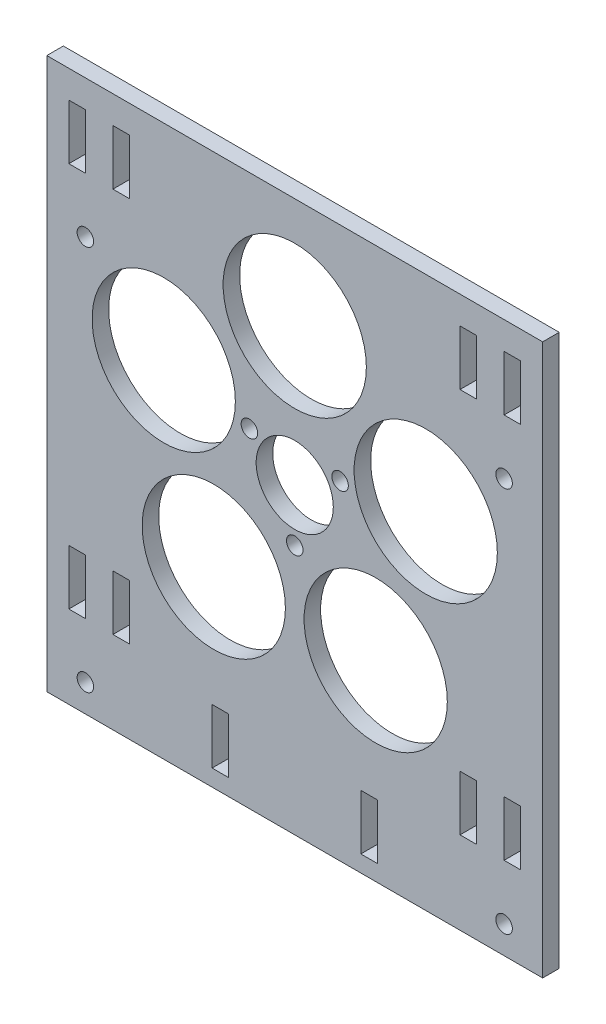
from build123d import *

# Parameters (mm, degrees)
EXTRUDE_2_DEPTH     = 3
SKETCH_5_W          = 3
SKETCH_5_H          = 10
CUT_EXTRUDE_1_DEPTH = 10
SKETCH_6_R          = 13
CUT_EXTRUDE_2_DEPTH = 10
SKETCH_7_R          = 7
SKETCH_7_R_2        = 1.5
CUT_EXTRUDE_3_DEPTH = 10
SKETCH_8_R          = 1.5
SKETCH_8_W          = 3
SKETCH_8_H          = 10
CUT_EXTRUDE_4_DEPTH = 10


with BuildPart() as part:
    # Sketch 3 → Extrude 2 (new body)
    with BuildSketch(Plane.XY):
        Polygon((45, 45), (-45, 45), (-45, -45), (-45, -55), (45, -55), (45, -45), align=None)
    extrude(amount=EXTRUDE_2_DEPTH)

    # Sketch 5 → Cut-Extrude 1 (cut)
    with BuildSketch(Plane.XY.offset(3)):
        with Locations((-31.5, 35)):
            Rectangle(SKETCH_5_W, SKETCH_5_H)
        with Locations((31.5, 35)):
            Rectangle(SKETCH_5_W, SKETCH_5_H)
        with Locations((-31.5, -35)):
            Rectangle(SKETCH_5_W, SKETCH_5_H)
        with Locations((31.5, -35)):
            Rectangle(SKETCH_5_W, SKETCH_5_H)
    extrude(amount=-CUT_EXTRUDE_1_DEPTH, mode=Mode.SUBTRACT)

    # Sketch 6 → Cut-Extrude 2 (cut)
    with BuildSketch(Plane.XY.offset(3)):
        with Locations((0, 25)):
            Circle(SKETCH_6_R)
        with Locations((23.776412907, 7.725424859)):
            Circle(SKETCH_6_R)
        with Locations((14.694631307, -20.225424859)):
            Circle(SKETCH_6_R)
        with Locations((-14.694631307, -20.225424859)):
            Circle(SKETCH_6_R)
        with Locations((-23.776412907, 7.725424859)):
            Circle(SKETCH_6_R)
    extrude(amount=-CUT_EXTRUDE_2_DEPTH, mode=Mode.SUBTRACT)

    # Sketch 7 → Cut-Extrude 3 (cut)
    with BuildSketch(Plane.XY.offset(3)):
        Circle(SKETCH_7_R)
        with Locations((0, -9.5)):
            Circle(SKETCH_7_R_2)
        with Locations((-8.227241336, 4.75)):
            Circle(SKETCH_7_R_2)
        with Locations((8.227241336, 4.75)):
            Circle(SKETCH_7_R_2)
    extrude(amount=-CUT_EXTRUDE_3_DEPTH, mode=Mode.SUBTRACT)

    # Sketch 8 → Cut-Extrude 4 (cut)
    with BuildSketch(Plane.XY.offset(3)):
        with Locations((-38, -50)):
            Circle(SKETCH_8_R)
        with Locations((-38, 20)):
            Circle(SKETCH_8_R)
        with Locations((38, 20)):
            Circle(SKETCH_8_R)
        with Locations((38, -50)):
            Circle(SKETCH_8_R)
        with Locations((-39.5, -35)):
            Rectangle(SKETCH_8_W, SKETCH_8_H)
        with Locations((-39.5, 35)):
            Rectangle(SKETCH_8_W, SKETCH_8_H)
        with Locations((-13.5, -47)):
            Rectangle(SKETCH_8_W, SKETCH_8_H)
        with Locations((13.5, -47)):
            Rectangle(SKETCH_8_W, SKETCH_8_H)
        with Locations((39.5, 35)):
            Rectangle(SKETCH_8_W, SKETCH_8_H)
        with Locations((39.5, -35)):
            Rectangle(SKETCH_8_W, SKETCH_8_H)
    extrude(amount=-CUT_EXTRUDE_4_DEPTH, mode=Mode.SUBTRACT)


solid = part.part
